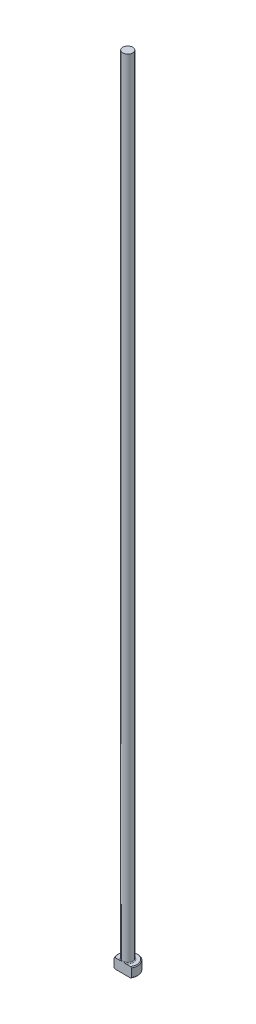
from build123d import *

# Parameters (mm, degrees)
CHAMFER1_SIZE = 0.254
FILLET1_R     = 0.254
KEY_DEPTH     = 255.0396844


with BuildPart() as part:
    # Sketch1 → Revolve1 (revolve)
    with BuildSketch(Plane.XY, mode=Mode.PRIVATE) as revolve1_sk:
        Polygon((0, 0), (-3.175, 0), (-3.175, 3.175), (-1.5875, 3.175), (-1.5875, 254), (0, 254), align=None)
    revolve(revolve1_sk.sketch.rotate(Axis((0, 259.958771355, 0), (0, -1, 0)), 270), axis=Axis((0, 259.958771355, 0), (0, -1, 0)))

    # Chamfer1
    chamfer1_edges = [part.edges().sort_by_distance(p)[0] for p in [
        (0, 3.175, -3.175),
        (0, 0, -3.175),
    ]]
    chamfer(chamfer1_edges, length=CHAMFER1_SIZE)

    # Fillet1
    fillet1_edges = [part.edges().sort_by_distance(p)[0] for p in [
        (0, 3.175, -1.5875),
    ]]
    fillet(fillet1_edges, radius=FILLET1_R)

    # Sketch2 → Key (cut, through all)
    with BuildSketch(Plane(origin=(0, 0, 0), x_dir=(1, 0, 0), z_dir=(0, 1, 0))):
        with BuildLine():
            Line((-2.749630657, -1.5875), (2.749630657, -1.5875))
            ThreePointArc((2.749630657, -1.5875), (0, -3.175), (-2.749630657, -1.5875))
        make_face()
    extrude(amount=KEY_DEPTH, mode=Mode.SUBTRACT)


solid = part.part
